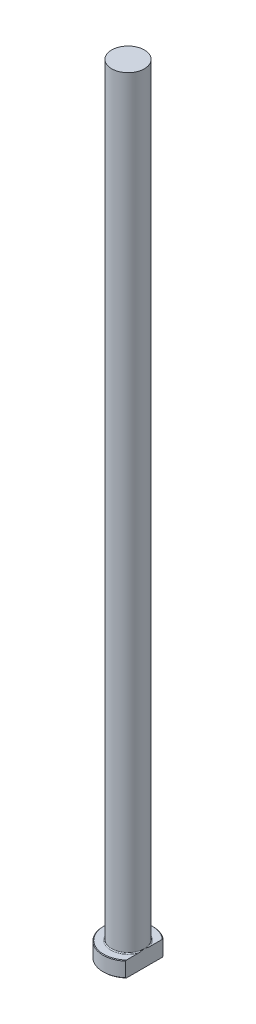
from build123d import *
from build123d.topology import SkipClean

# Parameters (mm, degrees)
CHAMFER1_SIZE = 0.2
FILLET1_R     = 0.3
KEY_DEPTH     = 251.255869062


with BuildPart() as part:
    # Sketch1 → Revolve1 (revolve)
    with BuildSketch(Plane.XY, mode=Mode.PRIVATE) as revolve1_sk:
        Polygon((0, 0), (-8, 0), (-8, 5), (-5.25, 5), (-5.25, 250), (0, 250), align=None)
    revolve(revolve1_sk.sketch.rotate(Axis((0, 259.958771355, 0), (0, -1, 0)), 270), axis=Axis((0, 259.958771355, 0), (0, -1, 0)))

    # Chamfer1
    chamfer1_edges = [part.edges().sort_by_distance(p)[0] for p in [
        (0, 5, -8),
        (0, 0, -8),
    ]]
    chamfer(chamfer1_edges, length=CHAMFER1_SIZE)

    # Fillet1
    fillet1_edges = [part.edges().sort_by_distance(p)[0] for p in [
        (0, 5, -5.25),
    ]]
    fillet(fillet1_edges, radius=FILLET1_R)

    # Sketch2 → KEY (cut, through all)
    with SkipClean():  # the faces are left unmerged after this step: merging them gives an invalid solid
        with BuildSketch(Plane(origin=(0, 0, 0), x_dir=(1, 0, 0), z_dir=(0, 1, 0))):
            with BuildLine():
                Line((5.25, 6.036348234), (5.25, -6.036348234))
                ThreePointArc((5.25, -6.036348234), (8, 0), (5.25, 6.036348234))
            make_face()
        extrude(amount=KEY_DEPTH, mode=Mode.SUBTRACT)


solid = part.part
